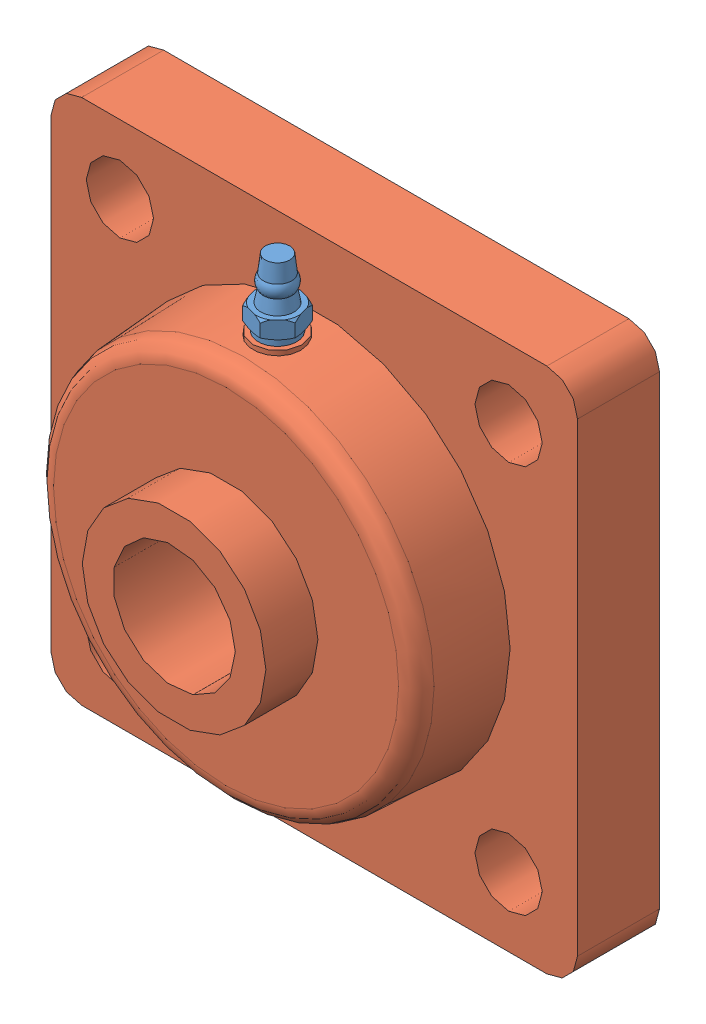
SolidWorks assembly 2451E-2460A.sldasm, configuration Défaut (file format 8000). Lengths in mm.
Overall size (86 86 36.3).
2 component instances, 2 part files, 0 mates.
Components (placement in the parent):
- 2460A-1: 2460A.sldprt [Défaut] at (0 32 19.4) x (0.262955 0 0.964808) z (-0.964808 0 0.262955) size (8.08 11 7)
- 2451E-1: 2451E.sldprt [Défaut] at origin size (86 86 36.3)
